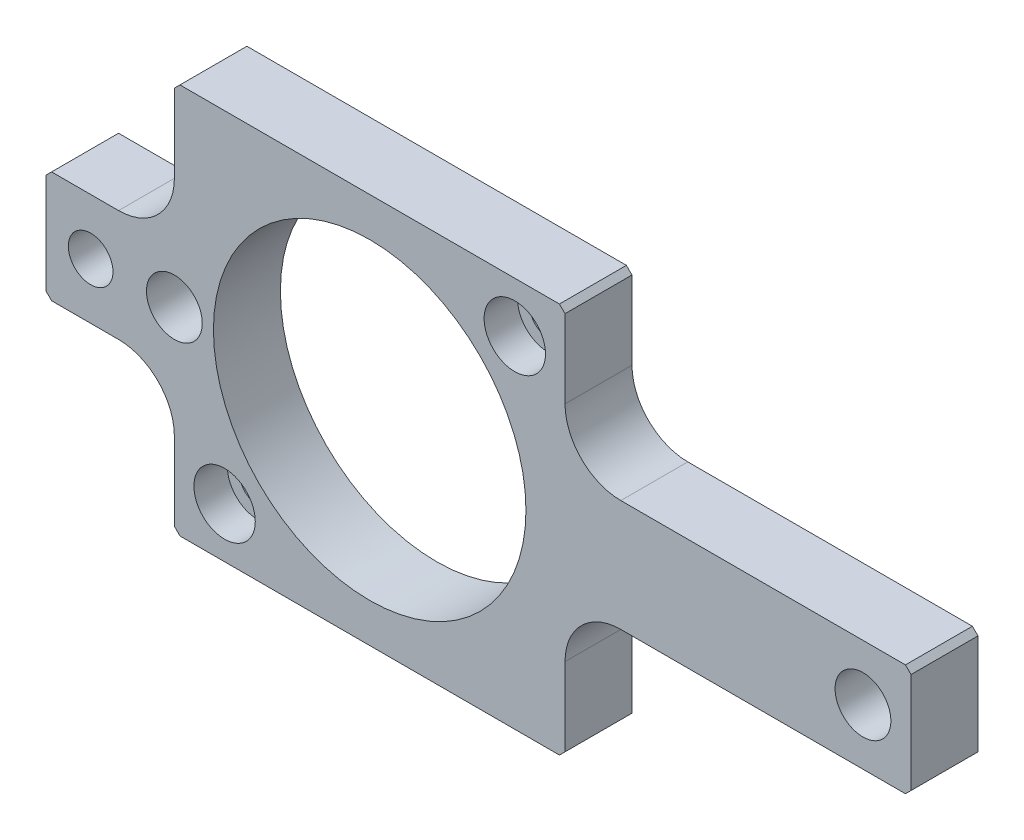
from build123d import *

# Parameters (mm, degrees)
ESQUISSE4_R             = 28
BASE_EXTRUSION_DEPTH    = 12
CHANFREIN2_SIZE         = 1
PER_AGE1_D              = 6.6
PER_AGE1_CBORE_D        = 11
PER_AGE1_CBORE_DEPTH    = 6
ESQUISSE7_R             = 5
ESQUISSE7_R_2           = 4
ENL_V_MAT_EXTRU_1_DEPTH = 150.89329538


with BuildPart() as part:
    # Esquisse4 → Base-Extrusion (new body)
    with BuildSketch(Plane.XY):
        with BuildLine():
            Line((0, 0), (70, 0))
            Line((70, 0), (70, 15))
            ThreePointArc((70, 15), (72.928932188, 22.071067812), (80, 25))
            Line((80, 25), (132, 25))
            Line((132, 25), (132, 45))
            Line((132, 45), (80, 45))
            ThreePointArc((80, 45), (72.928932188, 47.928932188), (70, 55))
            Line((70, 55), (70, 70))
            Line((70, 70), (0, 70))
            Line((0, 70), (0, 55))
            ThreePointArc((0, 55), (-2.928932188, 47.928932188), (-10, 45))
            Line((-10, 45), (-23, 45))
            Line((-23, 45), (-23, 25))
            Line((-23, 25), (-10, 25))
            ThreePointArc((-10, 25), (-2.928932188, 22.071067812), (0, 15))
            Line((0, 15), (0, 0))
        make_face()
        with Locations((35, 35)):
            Circle(ESQUISSE4_R, mode=Mode.SUBTRACT)
    extrude(amount=BASE_EXTRUSION_DEPTH)

    # Chanfrein2
    chanfrein2_edges = [part.edges().sort_by_distance(p)[0] for p in [
        (-23, 45, 6),
        (-23, 25, 6),
        (0, 0, 6),
        (70, 0, 6),
        (132, 25, 6),
        (132, 45, 6),
        (70, 70, 6),
        (0, 70, 6),
    ]]
    chamfer(chanfrein2_edges, length=CHANFREIN2_SIZE)

    # Per_age1 (through all)
    with Locations(Plane.XY.offset(12)):
        with Locations((9, 9), (61, 61)):
            CounterBoreHole(PER_AGE1_D / 2, PER_AGE1_CBORE_D / 2, PER_AGE1_CBORE_DEPTH)

    # Esquisse7 → Enl_v. mat.-Extru.1 (cut, through all)
    with BuildSketch(Plane.XY.offset(12)):
        with Locations((0, 35)):
            Circle(ESQUISSE7_R)
        with Locations((-15, 35)):
            Circle(ESQUISSE7_R_2)
        with Locations((123.39, 35)):
            Circle(ESQUISSE7_R)
    extrude(amount=-ENL_V_MAT_EXTRU_1_DEPTH, mode=Mode.SUBTRACT)


solid = part.part
